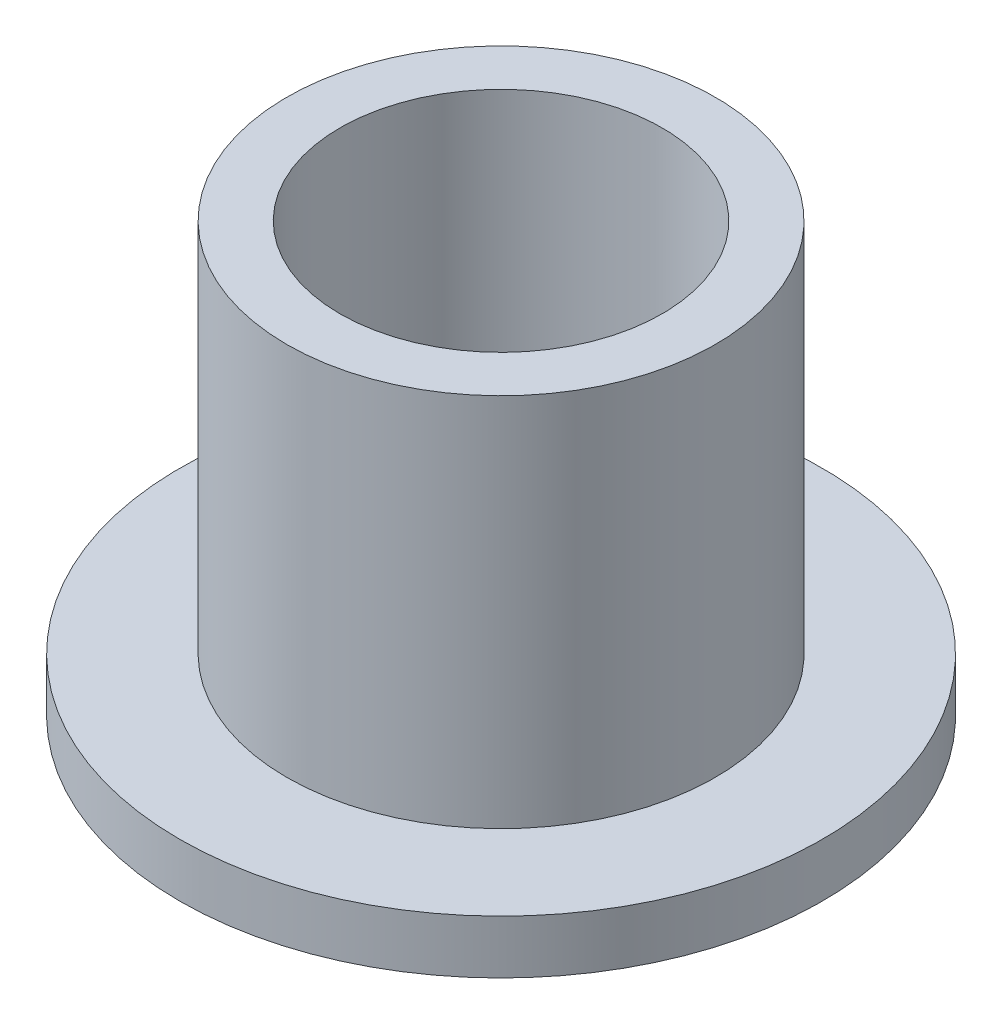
from build123d import *

# Parameters (mm, degrees)
SKETCH2_R           = 3.175
SKETCH2_R_2         = 2.3876
BOSS_EXTRUDE1_DEPTH = 6.35
SKETCH3_R           = 4.7625
SKETCH3_R_2         = 3.175
BOSS_EXTRUDE2_DEPTH = 0.79375


with BuildPart() as part:
    # Sketch2 → Boss-Extrude1 (new body)
    with BuildSketch(Plane(origin=(0, 0, 0), x_dir=(1, 0, 0), z_dir=(0, 1, 0))):
        with Locations(Location((0, 0, 0), (0, 0, 270))):
            Circle(SKETCH2_R)
        with Locations(Location((0, 0, 0), (0, 0, 270))):
            Circle(SKETCH2_R_2, mode=Mode.SUBTRACT)
    extrude(amount=BOSS_EXTRUDE1_DEPTH)

    # Sketch3 → Boss-Extrude2 (add)
    with BuildSketch(Plane(origin=(0, 0, 0), x_dir=(1, 0, 0), z_dir=(0, 1, 0))):
        with Locations(Location((0, 0, 0), (0, 0, 270))):
            Circle(SKETCH3_R)
        with Locations(Location((0, 0, 0), (0, 0, 270))):
            Circle(SKETCH3_R_2, mode=Mode.SUBTRACT)
    extrude(amount=BOSS_EXTRUDE2_DEPTH)


solid = part.part
